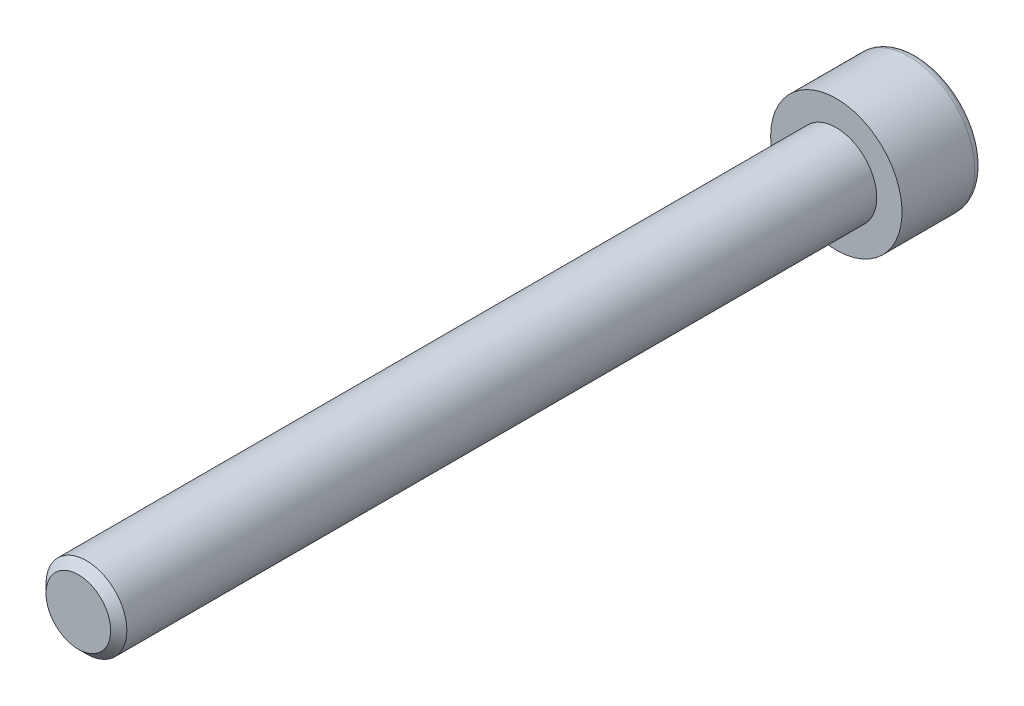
from build123d import *

# Parameters (mm, degrees)
ENLEV_MAT_EXTRU1_DEPTH = 4
ESQUISSE3_W            = 4
ESQUISSE3_H            = 75
CHANFREIN1_SIZE        = 0.8


with BuildPart() as part:
    # Esquisse1 → Base-R_volution (revolve)
    with BuildSketch(Plane(origin=(0, 0, 0), x_dir=(1, 0, 0), z_dir=(0, 1, 0)), mode=Mode.PRIVATE) as base_r_volution_sk:
        with BuildLine():
            Line((0, 0), (6.5, 0))
            Line((6.5, 0), (6.5, 7.2))
            ThreePointArc((6.5, 7.2), (6.265685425, 7.765685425), (5.7, 8))
            Line((5.7, 8), (0, 8))
            Line((0, 8), (0, 0))
        make_face()
    revolve(base_r_volution_sk.sketch.rotate(Axis((0, 0, 0), (0, 0, -1)), 180), axis=Axis((0, 0, 0), (0, 0, -1)))

    # Esquisse2 → enlev-mat-Extru1 (cut)
    with BuildSketch(Plane.XY.offset(-8)):
        Polygon((3, -1.732050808), (3, 1.732050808), (0, 3.464101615), (-3, 1.732050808), (-3, -1.732050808), (0, -3.464101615), align=None)
    extrude(amount=ENLEV_MAT_EXTRU1_DEPTH, mode=Mode.SUBTRACT)

    # Esquisse3 → Boss.-R_vol.1 (revolve)
    with BuildSketch(Plane(origin=(0, 0, 0), x_dir=(1, 0, 0), z_dir=(0, 1, 0))):
        with Locations((2, -37.5)):
            Rectangle(ESQUISSE3_W, ESQUISSE3_H)
    revolve(axis=Axis((0, 0, 0), (0, 0, 1)))

    # Chanfrein1
    chanfrein1_edges = [part.edges().sort_by_distance(p)[0] for p in [
        (-4, 0, 75),
    ]]
    chamfer(chanfrein1_edges, length=CHANFREIN1_SIZE)


solid = part.part
